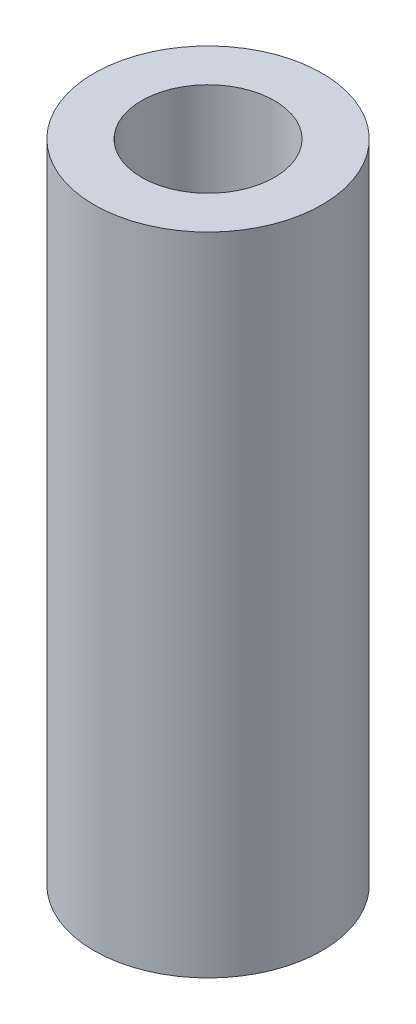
ISO-10303-21;
HEADER;
FILE_DESCRIPTION(('STEP AP214'),'2;1');
FILE_NAME('part.step','',(''),(''),'','','');
FILE_SCHEMA(('AUTOMOTIVE_DESIGN { 1 0 10303 214 1 1 1 1 }'));
ENDSEC;
DATA;
#1=APPLICATION_CONTEXT('core data for automotive mechanical design processes');
#2=APPLICATION_PROTOCOL_DEFINITION('international standard','automotive_design',2000,#1);
#3=PRODUCT_CONTEXT('',#1,'mechanical');
#4=PRODUCT('Part','Part','',(#3));
#5=PRODUCT_RELATED_PRODUCT_CATEGORY('part','',(#4));
#6=PRODUCT_DEFINITION_FORMATION('','',#4);
#7=PRODUCT_DEFINITION_CONTEXT('part definition',#1,'design');
#8=PRODUCT_DEFINITION('design','',#6,#7);
#9=PRODUCT_DEFINITION_SHAPE('','',#8);
#10=(LENGTH_UNIT() NAMED_UNIT(*) SI_UNIT(.MILLI.,.METRE.));
#11=(NAMED_UNIT(*) PLANE_ANGLE_UNIT() SI_UNIT($,.RADIAN.));
#12=(NAMED_UNIT(*) SI_UNIT($,.STERADIAN.) SOLID_ANGLE_UNIT());
#13=UNCERTAINTY_MEASURE_WITH_UNIT(LENGTH_MEASURE(1.E-05),#10,'distance_accuracy_value','');
#14=(GEOMETRIC_REPRESENTATION_CONTEXT(3) GLOBAL_UNCERTAINTY_ASSIGNED_CONTEXT((#13)) GLOBAL_UNIT_ASSIGNED_CONTEXT((#10,
#11,#12)) REPRESENTATION_CONTEXT('',''));
#15=CARTESIAN_POINT('',(0.,0.,0.));
#16=DIRECTION('',(0.,0.,1.));
#17=DIRECTION('',(1.,0.,0.));
#18=AXIS2_PLACEMENT_3D('',#15,#16,#17);
#19=CARTESIAN_POINT('',(0.,17.,0.));
#20=DIRECTION('',(0.,1.,0.));
#21=DIRECTION('',(0.,0.,1.));
#22=AXIS2_PLACEMENT_3D('',#19,#20,#21);
#23=PLANE('',#22);
#24=CARTESIAN_POINT('',(0.,17.,0.));
#25=DIRECTION('',(0.,1.,0.));
#26=DIRECTION('',(0.,0.,1.));
#27=AXIS2_PLACEMENT_3D('',#24,#25,#26);
#28=CIRCLE('',#27,3.);
#29=CARTESIAN_POINT('',(0.,17.,3.));
#30=VERTEX_POINT('',#29);
#31=EDGE_CURVE('E10',#30,#30,#28,.T.);
#32=ORIENTED_EDGE('',*,*,#31,.T.);
#33=EDGE_LOOP('',(#32));
#34=FACE_BOUND('',#33,.T.);
#35=CARTESIAN_POINT('',(0.,17.,0.));
#36=DIRECTION('',(0.,1.,0.));
#37=DIRECTION('',(0.,0.,1.));
#38=AXIS2_PLACEMENT_3D('',#35,#36,#37);
#39=CIRCLE('',#38,1.75);
#40=CARTESIAN_POINT('',(0.,17.,1.75));
#41=VERTEX_POINT('',#40);
#42=EDGE_CURVE('E39',#41,#41,#39,.T.);
#43=ORIENTED_EDGE('',*,*,#42,.F.);
#44=EDGE_LOOP('',(#43));
#45=FACE_BOUND('',#44,.T.);
#46=ADVANCED_FACE('F28',(#34,#45),#23,.T.);
#47=CARTESIAN_POINT('',(0.,0.,0.));
#48=DIRECTION('',(0.,1.,0.));
#49=DIRECTION('',(0.,0.,1.));
#50=AXIS2_PLACEMENT_3D('',#47,#48,#49);
#51=PLANE('',#50);
#52=CARTESIAN_POINT('',(0.,0.,0.));
#53=DIRECTION('',(0.,1.,0.));
#54=DIRECTION('',(0.,0.,1.));
#55=AXIS2_PLACEMENT_3D('',#52,#53,#54);
#56=CIRCLE('',#55,3.);
#57=CARTESIAN_POINT('',(0.,0.,3.));
#58=VERTEX_POINT('',#57);
#59=EDGE_CURVE('E35',#58,#58,#56,.T.);
#60=ORIENTED_EDGE('',*,*,#59,.F.);
#61=EDGE_LOOP('',(#60));
#62=FACE_BOUND('',#61,.T.);
#63=CARTESIAN_POINT('',(0.,0.,0.));
#64=DIRECTION('',(0.,1.,0.));
#65=DIRECTION('',(0.,0.,1.));
#66=AXIS2_PLACEMENT_3D('',#63,#64,#65);
#67=CIRCLE('',#66,1.75);
#68=CARTESIAN_POINT('',(0.,0.,1.75));
#69=VERTEX_POINT('',#68);
#70=EDGE_CURVE('E43',#69,#69,#67,.T.);
#71=ORIENTED_EDGE('',*,*,#70,.T.);
#72=EDGE_LOOP('',(#71));
#73=FACE_BOUND('',#72,.T.);
#74=ADVANCED_FACE('F49',(#62,#73),#51,.F.);
#75=CARTESIAN_POINT('',(0.,17.,0.));
#76=DIRECTION('',(0.,-1.,0.));
#77=DIRECTION('',(0.,0.,-1.));
#78=AXIS2_PLACEMENT_3D('',#75,#76,#77);
#79=CYLINDRICAL_SURFACE('',#78,3.);
#80=ORIENTED_EDGE('',*,*,#31,.F.);
#81=EDGE_LOOP('',(#80));
#82=FACE_BOUND('',#81,.T.);
#83=ORIENTED_EDGE('',*,*,#59,.T.);
#84=EDGE_LOOP('',(#83));
#85=FACE_BOUND('',#84,.T.);
#86=ADVANCED_FACE('F30',(#82,#85),#79,.T.);
#87=CARTESIAN_POINT('',(0.,17.,0.));
#88=DIRECTION('',(0.,-1.,0.));
#89=DIRECTION('',(0.,0.,-1.));
#90=AXIS2_PLACEMENT_3D('',#87,#88,#89);
#91=CYLINDRICAL_SURFACE('',#90,1.75);
#92=ORIENTED_EDGE('',*,*,#42,.T.);
#93=EDGE_LOOP('',(#92));
#94=FACE_BOUND('',#93,.T.);
#95=ORIENTED_EDGE('',*,*,#70,.F.);
#96=EDGE_LOOP('',(#95));
#97=FACE_BOUND('',#96,.T.);
#98=ADVANCED_FACE('F51',(#94,#97),#91,.F.);
#99=CLOSED_SHELL('',(#46,#74,#86,#98));
#100=MANIFOLD_SOLID_BREP('B2',#99);
#101=ADVANCED_BREP_SHAPE_REPRESENTATION('',(#18,#100),#14);
#102=SHAPE_DEFINITION_REPRESENTATION(#9,#101);
ENDSEC;
END-ISO-10303-21;
